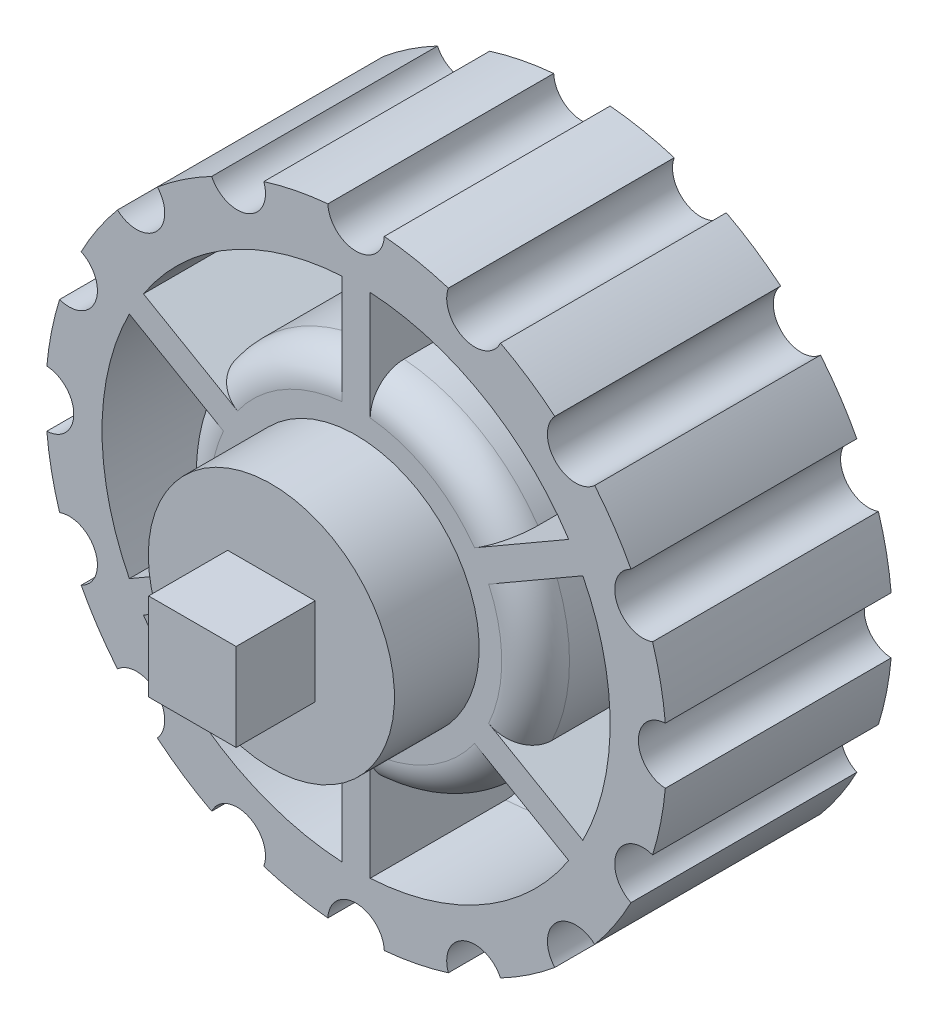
from build123d import *

# Parameters (mm, degrees)
SKETCH1_W           = 7.75
SKETCH1_H           = 7.75
BOSS_EXTRUDE1_DEPTH = 7
SKETCH3_R           = 10.9
BOSS_EXTRUDE2_DEPTH = 7.5
SKETCH4_R           = 27.5
BOSS_EXTRUDE3_DEPTH = 20
SKETCH5_R           = 2.5
CUT_EXTRUDE1_DEPTH  = 20
CIRPATTERN1_COUNT   = 16
CUT_EXTRUDE3_DEPTH  = 0.2
CIRPATTERN2_COUNT   = 2
SKETCH7_R           = 22.5
SKETCH7_R_2         = 15.9
CUT_EXTRUDE4_DEPTH  = 15
FILLET1_R           = 3
BOSS_EXTRUDE4_REACH = 45.589
SKETCH8_W           = 2.5
SKETCH8_H           = 18.625
CIRPATTERN3_COUNT   = 6


with BuildPart() as part:
    # Sketch1 → Boss-Extrude1 (new body)
    with BuildSketch(Plane.XY):
        Rectangle(SKETCH1_W, SKETCH1_H)
    extrude(amount=BOSS_EXTRUDE1_DEPTH)

    # Sketch3 → Boss-Extrude2 (add)
    with BuildSketch(Plane(origin=(0, 0, 0), x_dir=(-1, 0, 0), z_dir=(0, 0, -1))):
        Circle(SKETCH3_R)
    extrude(amount=BOSS_EXTRUDE2_DEPTH)

    # Sketch4 → Boss-Extrude3 (add)
    with BuildSketch(Plane(origin=(0, 0, -7.5), x_dir=(-1, 0, 0), z_dir=(0, 0, -1))):
        Circle(SKETCH4_R)
    extrude(amount=BOSS_EXTRUDE3_DEPTH)

    # Sketch5 → Cut-Extrude1 (cut)
    with BuildSketch(Plane(origin=(0, 0, -27.5), x_dir=(-1, 0, 0), z_dir=(0, 0, -1))):
        with Locations((0, 27.5)):
            Circle(SKETCH5_R)
    cut_extrude1 = extrude(amount=-CUT_EXTRUDE1_DEPTH, mode=Mode.SUBTRACT)

    # CirPattern1: Cut-Extrude1 ×16 about axis
    cirpattern1_axis = Axis((0, 0, 0), (0, 0, 1))
    for i in range(1, CIRPATTERN1_COUNT):
        add(cut_extrude1.rotate(cirpattern1_axis, i * 360 / CIRPATTERN1_COUNT), mode=Mode.SUBTRACT)

    # Sketch6 → Cut-Extrude3 (cut)
    with BuildSketch(Plane(origin=(0, 0, -27.5), x_dir=(-1, 0, 0), z_dir=(0, 0, -1))):
        with BuildLine():
            Line((-6.625, -11.4748366), (-6.25, -10.825317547))
            ThreePointArc((-6.25, -10.825317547), (-12.299711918, 2.228696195), (-2.054270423, 12.330043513))
            Line((-2.054270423, 12.330043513), (-2.114512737, 13.080188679))
            ThreePointArc((-2.114512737, 13.080188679), (-13.031964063, 2.393828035), (-6.625, -11.4748366))
        make_face()
        with BuildLine():
            Line((-7, -12.124355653), (-6.625, -11.4748366))
            ThreePointArc((-6.625, -11.4748366), (-13.031964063, 2.393828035), (-2.114512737, 13.080188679))
            Line((-2.114512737, 13.080188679), (-2.174732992, 13.830059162))
            ThreePointArc((-2.174732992, 13.830059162), (-13.764150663, 2.558936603), (-7, -12.124355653))
        make_face()
        with BuildLine():
            Line((-0.653025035, 12.482930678), (0, 13.25))
            ThreePointArc((0, 13.25), (-1.060660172, 13.207478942), (-2.114512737, 13.080188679))
            Line((-2.114512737, 13.080188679), (-2.054270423, 12.330043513))
            ThreePointArc((-2.054270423, 12.330043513), (-1.355804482, 12.426254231), (-0.653025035, 12.482930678))
        make_face()
        with BuildLine():
            Line((-1.944701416, 10.965675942), (-0.653025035, 12.482930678))
            ThreePointArc((-0.653025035, 12.482930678), (-1.355804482, 12.426254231), (-2.054270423, 12.330043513))
            Line((-2.054270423, 12.330043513), (-1.944701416, 10.965675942))
        make_face()
        with BuildLine():
            ThreePointArc((-2.114512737, 13.080188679), (-1.060660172, 13.207478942), (0, 13.25))
            Line((0, 13.25), (-0.850599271, 13.974136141))
            ThreePointArc((-0.850599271, 13.974136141), (-1.514380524, 13.917853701), (-2.174732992, 13.830059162))
            Line((-2.174732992, 13.830059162), (-2.114512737, 13.080188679))
        make_face()
        with BuildLine():
            ThreePointArc((-2.174732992, 13.830059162), (-1.514380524, 13.917853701), (-0.850599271, 13.974136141))
            Line((-0.850599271, 13.974136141), (-2.284324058, 15.194701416))
            Line((-2.284324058, 15.194701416), (-2.174732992, 13.830059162))
        make_face()
    cut_extrude3 = extrude(amount=-CUT_EXTRUDE3_DEPTH, mode=Mode.SUBTRACT)

    # CirPattern2: Cut-Extrude3 ×2 about axis
    cirpattern2_axis = Axis((0, 0, 0), (0, 0, 1))
    for i in range(1, CIRPATTERN2_COUNT):
        add(cut_extrude3.rotate(cirpattern2_axis, i * 360 / CIRPATTERN2_COUNT), mode=Mode.SUBTRACT)

    # Sketch7 → Cut-Extrude4 (cut)
    with BuildSketch(Plane.XY.offset(-7.5)):
        Circle(SKETCH7_R)
        Circle(SKETCH7_R_2, mode=Mode.SUBTRACT)
    extrude(amount=-CUT_EXTRUDE4_DEPTH, mode=Mode.SUBTRACT)

    # Fillet1
    fillet1_edges = [part.edges().sort_by_distance(p)[0] for p in [
        (-22.5, 0, -22.5),
        (-15.9, 0, -7.5),
        (-15.9, 0, -22.5),
    ]]
    fillet(fillet1_edges, radius=FILLET1_R)

    # Boss-Extrude4: up to this face of the body (flat: up to its plane)
    boss_extrude4_end = Plane(part.part.faces().sort_by_distance((-18.948456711, 0, -22.5))[0])
    # Sketch8 → Boss-Extrude4 (add, up to the picked face)
    with BuildSketch(Plane.XY.offset(-7.5), mode=Mode.PRIVATE) as boss_extrude4_sk1:
        with Locations((0, 13.1875)):
            Rectangle(SKETCH8_W, SKETCH8_H)
    boss_extrude4_tool1 = split(extrude(boss_extrude4_sk1.sketch, amount=-BOSS_EXTRUDE4_REACH, mode=Mode.PRIVATE), bisect_by=boss_extrude4_end, keep=Keep.BOTH, mode=Mode.PRIVATE)
    boss_extrude4 = boss_extrude4_tool1.solids().sort_by(Axis((0, 13.1875, -7.5), (0, 0, -1)))[0]
    add(boss_extrude4)

    # CirPattern3: Boss-Extrude4 ×6 about axis
    cirpattern3_axis = Axis((0, 0, 0), (0, 0, 1))
    for i in range(1, CIRPATTERN3_COUNT):
        add(boss_extrude4.rotate(cirpattern3_axis, i * 360 / CIRPATTERN3_COUNT))


solid = part.part
